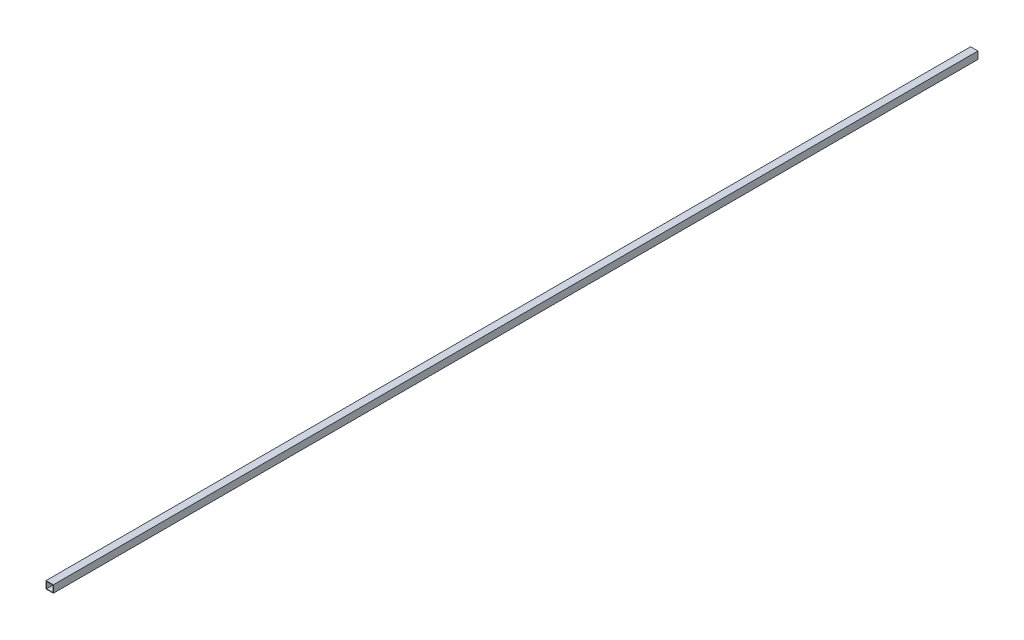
from build123d import *

# Parameters (mm, degrees)
ESQUISSE1_W        = 80
ESQUISSE1_H        = 80
ESQUISSE1_W_2      = 70
ESQUISSE1_H_2      = 70
BOSS_EXTRU_1_DEPTH = 10080


with BuildPart() as part:
    # Esquisse1 → Boss.-Extru.1 (new body)
    with BuildSketch(Plane.XY):
        Rectangle(ESQUISSE1_W, ESQUISSE1_H)
        Rectangle(ESQUISSE1_W_2, ESQUISSE1_H_2, mode=Mode.SUBTRACT)
    extrude(amount=-BOSS_EXTRU_1_DEPTH)


solid = part.part
